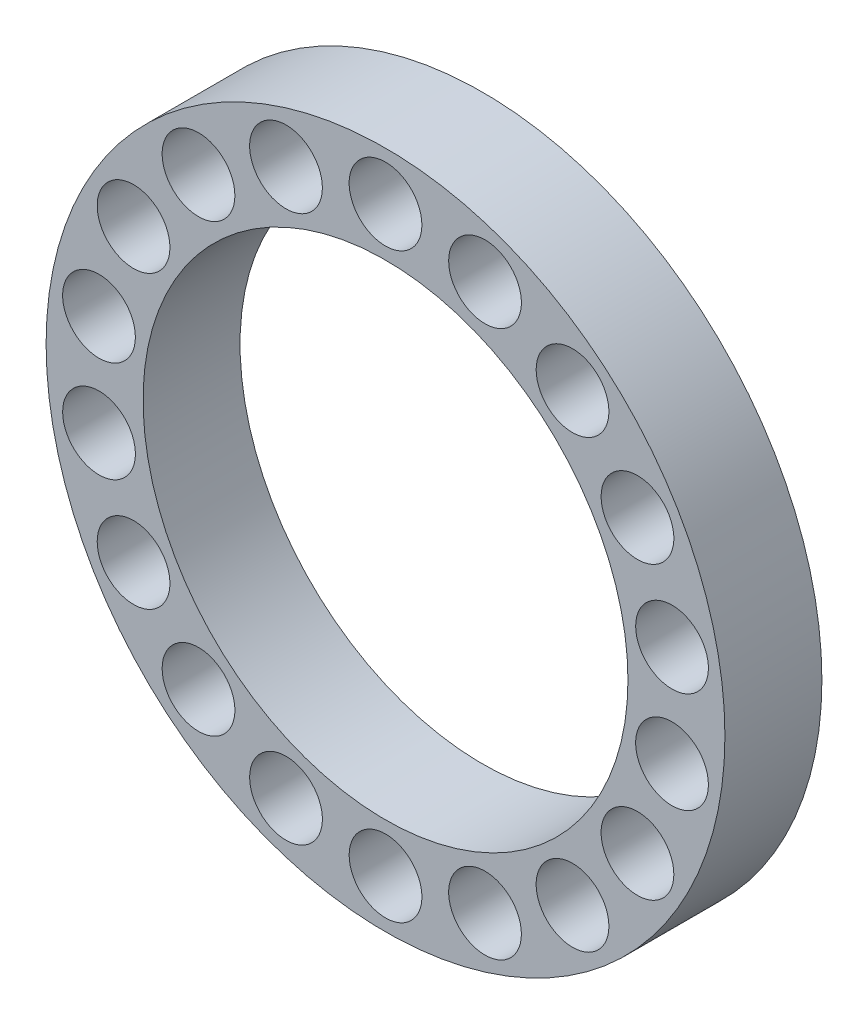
ISO-10303-21;
HEADER;
FILE_DESCRIPTION(('STEP AP214'),'2;1');
FILE_NAME('part.step','',(''),(''),'','','');
FILE_SCHEMA(('AUTOMOTIVE_DESIGN { 1 0 10303 214 1 1 1 1 }'));
ENDSEC;
DATA;
#1=APPLICATION_CONTEXT('core data for automotive mechanical design processes');
#2=APPLICATION_PROTOCOL_DEFINITION('international standard','automotive_design',2000,#1);
#3=PRODUCT_CONTEXT('',#1,'mechanical');
#4=PRODUCT('Part','Part','',(#3));
#5=PRODUCT_RELATED_PRODUCT_CATEGORY('part','',(#4));
#6=PRODUCT_DEFINITION_FORMATION('','',#4);
#7=PRODUCT_DEFINITION_CONTEXT('part definition',#1,'design');
#8=PRODUCT_DEFINITION('design','',#6,#7);
#9=PRODUCT_DEFINITION_SHAPE('','',#8);
#10=(LENGTH_UNIT() NAMED_UNIT(*) SI_UNIT(.MILLI.,.METRE.));
#11=(NAMED_UNIT(*) PLANE_ANGLE_UNIT() SI_UNIT($,.RADIAN.));
#12=(NAMED_UNIT(*) SI_UNIT($,.STERADIAN.) SOLID_ANGLE_UNIT());
#13=UNCERTAINTY_MEASURE_WITH_UNIT(LENGTH_MEASURE(1.E-05),#10,'distance_accuracy_value','');
#14=(GEOMETRIC_REPRESENTATION_CONTEXT(3) GLOBAL_UNCERTAINTY_ASSIGNED_CONTEXT((#13)) GLOBAL_UNIT_ASSIGNED_CONTEXT((#10,
#11,#12)) REPRESENTATION_CONTEXT('',''));
#15=CARTESIAN_POINT('',(0.,0.,0.));
#16=DIRECTION('',(0.,0.,1.));
#17=DIRECTION('',(1.,0.,0.));
#18=AXIS2_PLACEMENT_3D('',#15,#16,#17);
#19=CARTESIAN_POINT('',(0.,0.,2.54));
#20=DIRECTION('',(0.,0.,1.));
#21=DIRECTION('',(1.,0.,0.));
#22=AXIS2_PLACEMENT_3D('',#19,#20,#21);
#23=PLANE('',#22);
#24=CARTESIAN_POINT('',(6.59911357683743,3.80999999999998,2.54));
#25=DIRECTION('',(0.,0.,1.));
#26=DIRECTION('',(-1.,0.,0.));
#27=AXIS2_PLACEMENT_3D('',#24,#25,#26);
#28=CIRCLE('',#27,0.9525);
#29=CARTESIAN_POINT('',(5.64661357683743,3.80999999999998,2.54));
#30=VERTEX_POINT('',#29);
#31=EDGE_CURVE('E142',#30,#30,#28,.T.);
#32=ORIENTED_EDGE('',*,*,#31,.F.);
#33=EDGE_LOOP('',(#32));
#34=FACE_BOUND('',#33,.T.);
#35=CARTESIAN_POINT('',(2.6061934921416,7.16045777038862,2.54));
#36=DIRECTION('',(0.,0.,1.));
#37=DIRECTION('',(-1.,0.,0.));
#38=AXIS2_PLACEMENT_3D('',#35,#36,#37);
#39=CIRCLE('',#38,0.952500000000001);
#40=CARTESIAN_POINT('',(1.6536934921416,7.16045777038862,2.54));
#41=VERTEX_POINT('',#40);
#42=EDGE_CURVE('E130',#41,#41,#39,.T.);
#43=ORIENTED_EDGE('',*,*,#42,.F.);
#44=EDGE_LOOP('',(#43));
#45=FACE_BOUND('',#44,.T.);
#46=CARTESIAN_POINT('',(7.50423507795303,-1.32319911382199,2.54));
#47=DIRECTION('',(0.,0.,1.));
#48=DIRECTION('',(1.,0.,0.));
#49=AXIS2_PLACEMENT_3D('',#46,#47,#48);
#50=CIRCLE('',#49,0.952499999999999);
#51=CARTESIAN_POINT('',(8.45673507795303,-1.32319911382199,2.54));
#52=VERTEX_POINT('',#51);
#53=EDGE_CURVE('E118',#52,#52,#50,.T.);
#54=ORIENTED_EDGE('',*,*,#53,.F.);
#55=EDGE_LOOP('',(#54));
#56=FACE_BOUND('',#55,.T.);
#57=CARTESIAN_POINT('',(4.89804158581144,-5.83725865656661,2.54));
#58=DIRECTION('',(0.,0.,1.));
#59=DIRECTION('',(1.,0.,0.));
#60=AXIS2_PLACEMENT_3D('',#57,#58,#59);
#61=CIRCLE('',#60,0.952500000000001);
#62=CARTESIAN_POINT('',(5.85054158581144,-5.83725865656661,2.54));
#63=VERTEX_POINT('',#62);
#64=EDGE_CURVE('E106',#63,#63,#61,.T.);
#65=ORIENTED_EDGE('',*,*,#64,.F.);
#66=EDGE_LOOP('',(#65));
#67=FACE_BOUND('',#66,.T.);
#68=CARTESIAN_POINT('',(-6.59911357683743,-3.80999999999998,2.54));
#69=DIRECTION('',(0.,0.,1.));
#70=DIRECTION('',(-1.,0.,0.));
#71=AXIS2_PLACEMENT_3D('',#68,#69,#70);
#72=CIRCLE('',#71,0.9525);
#73=CARTESIAN_POINT('',(-7.55161357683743,-3.80999999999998,2.54));
#74=VERTEX_POINT('',#73);
#75=EDGE_CURVE('E94',#74,#74,#72,.T.);
#76=ORIENTED_EDGE('',*,*,#75,.F.);
#77=EDGE_LOOP('',(#76));
#78=FACE_BOUND('',#77,.T.);
#79=CARTESIAN_POINT('',(0.,-7.62,2.54));
#80=DIRECTION('',(0.,0.,1.));
#81=DIRECTION('',(-1.,0.,0.));
#82=AXIS2_PLACEMENT_3D('',#79,#80,#81);
#83=CIRCLE('',#82,0.9525);
#84=CARTESIAN_POINT('',(-0.9525,-7.62,2.54));
#85=VERTEX_POINT('',#84);
#86=EDGE_CURVE('E82',#85,#85,#83,.T.);
#87=ORIENTED_EDGE('',*,*,#86,.F.);
#88=EDGE_LOOP('',(#87));
#89=FACE_BOUND('',#88,.T.);
#90=CARTESIAN_POINT('',(-2.6061934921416,7.16045777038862,2.54));
#91=DIRECTION('',(0.,0.,1.));
#92=DIRECTION('',(1.,0.,0.));
#93=AXIS2_PLACEMENT_3D('',#90,#91,#92);
#94=CIRCLE('',#93,0.952500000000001);
#95=CARTESIAN_POINT('',(-1.6536934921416,7.16045777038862,2.54));
#96=VERTEX_POINT('',#95);
#97=EDGE_CURVE('E70',#96,#96,#94,.T.);
#98=ORIENTED_EDGE('',*,*,#97,.F.);
#99=EDGE_LOOP('',(#98));
#100=FACE_BOUND('',#99,.T.);
#101=CARTESIAN_POINT('',(-6.59911357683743,3.80999999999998,2.54));
#102=DIRECTION('',(0.,0.,1.));
#103=DIRECTION('',(1.,0.,0.));
#104=AXIS2_PLACEMENT_3D('',#101,#102,#103);
#105=CIRCLE('',#104,0.9525);
#106=CARTESIAN_POINT('',(-5.64661357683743,3.80999999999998,2.54));
#107=VERTEX_POINT('',#106);
#108=EDGE_CURVE('E58',#107,#107,#105,.T.);
#109=ORIENTED_EDGE('',*,*,#108,.F.);
#110=EDGE_LOOP('',(#109));
#111=FACE_BOUND('',#110,.T.);
#112=CARTESIAN_POINT('',(-4.89804158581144,5.83725865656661,2.54));
#113=DIRECTION('',(0.,0.,1.));
#114=DIRECTION('',(1.,0.,0.));
#115=AXIS2_PLACEMENT_3D('',#112,#113,#114);
#116=CIRCLE('',#115,0.952500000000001);
#117=CARTESIAN_POINT('',(-3.94554158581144,5.83725865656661,2.54));
#118=VERTEX_POINT('',#117);
#119=EDGE_CURVE('E46',#118,#118,#116,.T.);
#120=ORIENTED_EDGE('',*,*,#119,.F.);
#121=EDGE_LOOP('',(#120));
#122=FACE_BOUND('',#121,.T.);
#123=CARTESIAN_POINT('',(0.,0.,2.54));
#124=DIRECTION('',(0.,0.,1.));
#125=DIRECTION('',(1.,0.,0.));
#126=AXIS2_PLACEMENT_3D('',#123,#124,#125);
#127=CIRCLE('',#126,8.89);
#128=CARTESIAN_POINT('',(8.89,0.,2.54));
#129=VERTEX_POINT('',#128);
#130=EDGE_CURVE('E10',#129,#129,#127,.T.);
#131=ORIENTED_EDGE('',*,*,#130,.T.);
#132=EDGE_LOOP('',(#131));
#133=FACE_BOUND('',#132,.T.);
#134=CARTESIAN_POINT('',(0.,0.,2.54));
#135=DIRECTION('',(0.,0.,1.));
#136=DIRECTION('',(1.,0.,0.));
#137=AXIS2_PLACEMENT_3D('',#134,#135,#136);
#138=CIRCLE('',#137,6.35);
#139=CARTESIAN_POINT('',(6.35,0.,2.54));
#140=VERTEX_POINT('',#139);
#141=EDGE_CURVE('E41',#140,#140,#138,.T.);
#142=ORIENTED_EDGE('',*,*,#141,.F.);
#143=EDGE_LOOP('',(#142));
#144=FACE_BOUND('',#143,.T.);
#145=CARTESIAN_POINT('',(-7.50423507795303,1.32319911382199,2.54));
#146=DIRECTION('',(0.,0.,1.));
#147=DIRECTION('',(1.,0.,0.));
#148=AXIS2_PLACEMENT_3D('',#145,#146,#147);
#149=CIRCLE('',#148,0.952499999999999);
#150=CARTESIAN_POINT('',(-6.55173507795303,1.32319911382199,2.54));
#151=VERTEX_POINT('',#150);
#152=EDGE_CURVE('E52',#151,#151,#149,.T.);
#153=ORIENTED_EDGE('',*,*,#152,.F.);
#154=EDGE_LOOP('',(#153));
#155=FACE_BOUND('',#154,.T.);
#156=CARTESIAN_POINT('',(0.,7.62,2.54));
#157=DIRECTION('',(0.,0.,1.));
#158=DIRECTION('',(1.,0.,0.));
#159=AXIS2_PLACEMENT_3D('',#156,#157,#158);
#160=CIRCLE('',#159,0.9525);
#161=CARTESIAN_POINT('',(0.9525,7.62,2.54));
#162=VERTEX_POINT('',#161);
#163=EDGE_CURVE('E64',#162,#162,#160,.T.);
#164=ORIENTED_EDGE('',*,*,#163,.F.);
#165=EDGE_LOOP('',(#164));
#166=FACE_BOUND('',#165,.T.);
#167=CARTESIAN_POINT('',(-2.6061934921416,-7.16045777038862,2.54));
#168=DIRECTION('',(0.,0.,1.));
#169=DIRECTION('',(-1.,0.,0.));
#170=AXIS2_PLACEMENT_3D('',#167,#168,#169);
#171=CIRCLE('',#170,0.952500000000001);
#172=CARTESIAN_POINT('',(-3.5586934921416,-7.16045777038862,2.54));
#173=VERTEX_POINT('',#172);
#174=EDGE_CURVE('E76',#173,#173,#171,.T.);
#175=ORIENTED_EDGE('',*,*,#174,.F.);
#176=EDGE_LOOP('',(#175));
#177=FACE_BOUND('',#176,.T.);
#178=CARTESIAN_POINT('',(-7.50423507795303,-1.32319911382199,2.54));
#179=DIRECTION('',(0.,0.,1.));
#180=DIRECTION('',(-1.,0.,0.));
#181=AXIS2_PLACEMENT_3D('',#178,#179,#180);
#182=CIRCLE('',#181,0.952499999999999);
#183=CARTESIAN_POINT('',(-8.45673507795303,-1.32319911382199,2.54));
#184=VERTEX_POINT('',#183);
#185=EDGE_CURVE('E88',#184,#184,#182,.T.);
#186=ORIENTED_EDGE('',*,*,#185,.F.);
#187=EDGE_LOOP('',(#186));
#188=FACE_BOUND('',#187,.T.);
#189=CARTESIAN_POINT('',(-4.89804158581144,-5.83725865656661,2.54));
#190=DIRECTION('',(0.,0.,1.));
#191=DIRECTION('',(-1.,0.,0.));
#192=AXIS2_PLACEMENT_3D('',#189,#190,#191);
#193=CIRCLE('',#192,0.952500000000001);
#194=CARTESIAN_POINT('',(-5.85054158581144,-5.83725865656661,2.54));
#195=VERTEX_POINT('',#194);
#196=EDGE_CURVE('E100',#195,#195,#193,.T.);
#197=ORIENTED_EDGE('',*,*,#196,.F.);
#198=EDGE_LOOP('',(#197));
#199=FACE_BOUND('',#198,.T.);
#200=CARTESIAN_POINT('',(6.59911357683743,-3.80999999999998,2.54));
#201=DIRECTION('',(0.,0.,1.));
#202=DIRECTION('',(1.,0.,0.));
#203=AXIS2_PLACEMENT_3D('',#200,#201,#202);
#204=CIRCLE('',#203,0.9525);
#205=CARTESIAN_POINT('',(7.55161357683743,-3.80999999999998,2.54));
#206=VERTEX_POINT('',#205);
#207=EDGE_CURVE('E112',#206,#206,#204,.T.);
#208=ORIENTED_EDGE('',*,*,#207,.F.);
#209=EDGE_LOOP('',(#208));
#210=FACE_BOUND('',#209,.T.);
#211=CARTESIAN_POINT('',(2.6061934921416,-7.16045777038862,2.54));
#212=DIRECTION('',(0.,0.,1.));
#213=DIRECTION('',(1.,0.,0.));
#214=AXIS2_PLACEMENT_3D('',#211,#212,#213);
#215=CIRCLE('',#214,0.952500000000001);
#216=CARTESIAN_POINT('',(3.5586934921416,-7.16045777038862,2.54));
#217=VERTEX_POINT('',#216);
#218=EDGE_CURVE('E124',#217,#217,#215,.T.);
#219=ORIENTED_EDGE('',*,*,#218,.F.);
#220=EDGE_LOOP('',(#219));
#221=FACE_BOUND('',#220,.T.);
#222=CARTESIAN_POINT('',(7.50423507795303,1.32319911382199,2.54));
#223=DIRECTION('',(0.,0.,1.));
#224=DIRECTION('',(-1.,0.,0.));
#225=AXIS2_PLACEMENT_3D('',#222,#223,#224);
#226=CIRCLE('',#225,0.952499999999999);
#227=CARTESIAN_POINT('',(6.55173507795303,1.32319911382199,2.54));
#228=VERTEX_POINT('',#227);
#229=EDGE_CURVE('E136',#228,#228,#226,.T.);
#230=ORIENTED_EDGE('',*,*,#229,.F.);
#231=EDGE_LOOP('',(#230));
#232=FACE_BOUND('',#231,.T.);
#233=CARTESIAN_POINT('',(4.89804158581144,5.83725865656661,2.54));
#234=DIRECTION('',(0.,0.,1.));
#235=DIRECTION('',(-1.,0.,0.));
#236=AXIS2_PLACEMENT_3D('',#233,#234,#235);
#237=CIRCLE('',#236,0.952500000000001);
#238=CARTESIAN_POINT('',(3.94554158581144,5.83725865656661,2.54));
#239=VERTEX_POINT('',#238);
#240=EDGE_CURVE('E148',#239,#239,#237,.T.);
#241=ORIENTED_EDGE('',*,*,#240,.F.);
#242=EDGE_LOOP('',(#241));
#243=FACE_BOUND('',#242,.T.);
#244=ADVANCED_FACE('F30',(#34,#45,#56,#67,#78,#89,#100,#111,#122,#133,#144,#155,#166,#177,#188,
#199,#210,#221,#232,#243),#23,.T.);
#245=CARTESIAN_POINT('',(0.,0.,0.));
#246=DIRECTION('',(0.,0.,1.));
#247=DIRECTION('',(1.,0.,0.));
#248=AXIS2_PLACEMENT_3D('',#245,#246,#247);
#249=PLANE('',#248);
#250=CARTESIAN_POINT('',(6.59911357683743,3.80999999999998,0.));
#251=DIRECTION('',(0.,0.,1.));
#252=DIRECTION('',(-1.,0.,0.));
#253=AXIS2_PLACEMENT_3D('',#250,#251,#252);
#254=CIRCLE('',#253,0.9525);
#255=CARTESIAN_POINT('',(5.64661357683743,3.80999999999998,0.));
#256=VERTEX_POINT('',#255);
#257=EDGE_CURVE('E145',#256,#256,#254,.T.);
#258=ORIENTED_EDGE('',*,*,#257,.T.);
#259=EDGE_LOOP('',(#258));
#260=FACE_BOUND('',#259,.T.);
#261=CARTESIAN_POINT('',(2.6061934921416,7.16045777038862,0.));
#262=DIRECTION('',(0.,0.,1.));
#263=DIRECTION('',(-1.,0.,0.));
#264=AXIS2_PLACEMENT_3D('',#261,#262,#263);
#265=CIRCLE('',#264,0.952500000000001);
#266=CARTESIAN_POINT('',(1.6536934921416,7.16045777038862,0.));
#267=VERTEX_POINT('',#266);
#268=EDGE_CURVE('E133',#267,#267,#265,.T.);
#269=ORIENTED_EDGE('',*,*,#268,.T.);
#270=EDGE_LOOP('',(#269));
#271=FACE_BOUND('',#270,.T.);
#272=CARTESIAN_POINT('',(7.50423507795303,-1.32319911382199,0.));
#273=DIRECTION('',(0.,0.,1.));
#274=DIRECTION('',(1.,0.,0.));
#275=AXIS2_PLACEMENT_3D('',#272,#273,#274);
#276=CIRCLE('',#275,0.952499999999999);
#277=CARTESIAN_POINT('',(8.45673507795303,-1.32319911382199,0.));
#278=VERTEX_POINT('',#277);
#279=EDGE_CURVE('E121',#278,#278,#276,.T.);
#280=ORIENTED_EDGE('',*,*,#279,.T.);
#281=EDGE_LOOP('',(#280));
#282=FACE_BOUND('',#281,.T.);
#283=CARTESIAN_POINT('',(4.89804158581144,-5.83725865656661,0.));
#284=DIRECTION('',(0.,0.,1.));
#285=DIRECTION('',(1.,0.,0.));
#286=AXIS2_PLACEMENT_3D('',#283,#284,#285);
#287=CIRCLE('',#286,0.952500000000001);
#288=CARTESIAN_POINT('',(5.85054158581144,-5.83725865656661,0.));
#289=VERTEX_POINT('',#288);
#290=EDGE_CURVE('E109',#289,#289,#287,.T.);
#291=ORIENTED_EDGE('',*,*,#290,.T.);
#292=EDGE_LOOP('',(#291));
#293=FACE_BOUND('',#292,.T.);
#294=CARTESIAN_POINT('',(-6.59911357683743,-3.80999999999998,0.));
#295=DIRECTION('',(0.,0.,1.));
#296=DIRECTION('',(-1.,0.,0.));
#297=AXIS2_PLACEMENT_3D('',#294,#295,#296);
#298=CIRCLE('',#297,0.9525);
#299=CARTESIAN_POINT('',(-7.55161357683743,-3.80999999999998,0.));
#300=VERTEX_POINT('',#299);
#301=EDGE_CURVE('E97',#300,#300,#298,.T.);
#302=ORIENTED_EDGE('',*,*,#301,.T.);
#303=EDGE_LOOP('',(#302));
#304=FACE_BOUND('',#303,.T.);
#305=CARTESIAN_POINT('',(0.,-7.62,0.));
#306=DIRECTION('',(0.,0.,1.));
#307=DIRECTION('',(-1.,0.,0.));
#308=AXIS2_PLACEMENT_3D('',#305,#306,#307);
#309=CIRCLE('',#308,0.9525);
#310=CARTESIAN_POINT('',(-0.9525,-7.62,0.));
#311=VERTEX_POINT('',#310);
#312=EDGE_CURVE('E85',#311,#311,#309,.T.);
#313=ORIENTED_EDGE('',*,*,#312,.T.);
#314=EDGE_LOOP('',(#313));
#315=FACE_BOUND('',#314,.T.);
#316=CARTESIAN_POINT('',(-2.6061934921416,7.16045777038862,0.));
#317=DIRECTION('',(0.,0.,1.));
#318=DIRECTION('',(1.,0.,0.));
#319=AXIS2_PLACEMENT_3D('',#316,#317,#318);
#320=CIRCLE('',#319,0.952500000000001);
#321=CARTESIAN_POINT('',(-1.6536934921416,7.16045777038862,0.));
#322=VERTEX_POINT('',#321);
#323=EDGE_CURVE('E73',#322,#322,#320,.T.);
#324=ORIENTED_EDGE('',*,*,#323,.T.);
#325=EDGE_LOOP('',(#324));
#326=FACE_BOUND('',#325,.T.);
#327=CARTESIAN_POINT('',(-6.59911357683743,3.80999999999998,0.));
#328=DIRECTION('',(0.,0.,1.));
#329=DIRECTION('',(1.,0.,0.));
#330=AXIS2_PLACEMENT_3D('',#327,#328,#329);
#331=CIRCLE('',#330,0.9525);
#332=CARTESIAN_POINT('',(-5.64661357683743,3.80999999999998,0.));
#333=VERTEX_POINT('',#332);
#334=EDGE_CURVE('E61',#333,#333,#331,.T.);
#335=ORIENTED_EDGE('',*,*,#334,.T.);
#336=EDGE_LOOP('',(#335));
#337=FACE_BOUND('',#336,.T.);
#338=CARTESIAN_POINT('',(-4.89804158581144,5.83725865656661,0.));
#339=DIRECTION('',(0.,0.,1.));
#340=DIRECTION('',(1.,0.,0.));
#341=AXIS2_PLACEMENT_3D('',#338,#339,#340);
#342=CIRCLE('',#341,0.952500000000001);
#343=CARTESIAN_POINT('',(-3.94554158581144,5.83725865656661,0.));
#344=VERTEX_POINT('',#343);
#345=EDGE_CURVE('E49',#344,#344,#342,.T.);
#346=ORIENTED_EDGE('',*,*,#345,.T.);
#347=EDGE_LOOP('',(#346));
#348=FACE_BOUND('',#347,.T.);
#349=CARTESIAN_POINT('',(0.,0.,0.));
#350=DIRECTION('',(0.,0.,1.));
#351=DIRECTION('',(1.,0.,0.));
#352=AXIS2_PLACEMENT_3D('',#349,#350,#351);
#353=CIRCLE('',#352,8.89);
#354=CARTESIAN_POINT('',(8.89,0.,0.));
#355=VERTEX_POINT('',#354);
#356=EDGE_CURVE('E34',#355,#355,#353,.T.);
#357=ORIENTED_EDGE('',*,*,#356,.F.);
#358=EDGE_LOOP('',(#357));
#359=FACE_BOUND('',#358,.T.);
#360=CARTESIAN_POINT('',(0.,0.,0.));
#361=DIRECTION('',(0.,0.,1.));
#362=DIRECTION('',(1.,0.,0.));
#363=AXIS2_PLACEMENT_3D('',#360,#361,#362);
#364=CIRCLE('',#363,6.35);
#365=CARTESIAN_POINT('',(6.35,0.,0.));
#366=VERTEX_POINT('',#365);
#367=EDGE_CURVE('E43',#366,#366,#364,.T.);
#368=ORIENTED_EDGE('',*,*,#367,.T.);
#369=EDGE_LOOP('',(#368));
#370=FACE_BOUND('',#369,.T.);
#371=CARTESIAN_POINT('',(-7.50423507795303,1.32319911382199,0.));
#372=DIRECTION('',(0.,0.,1.));
#373=DIRECTION('',(1.,0.,0.));
#374=AXIS2_PLACEMENT_3D('',#371,#372,#373);
#375=CIRCLE('',#374,0.952499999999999);
#376=CARTESIAN_POINT('',(-6.55173507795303,1.32319911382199,0.));
#377=VERTEX_POINT('',#376);
#378=EDGE_CURVE('E55',#377,#377,#375,.T.);
#379=ORIENTED_EDGE('',*,*,#378,.T.);
#380=EDGE_LOOP('',(#379));
#381=FACE_BOUND('',#380,.T.);
#382=CARTESIAN_POINT('',(0.,7.62,0.));
#383=DIRECTION('',(0.,0.,1.));
#384=DIRECTION('',(1.,0.,0.));
#385=AXIS2_PLACEMENT_3D('',#382,#383,#384);
#386=CIRCLE('',#385,0.9525);
#387=CARTESIAN_POINT('',(0.9525,7.62,0.));
#388=VERTEX_POINT('',#387);
#389=EDGE_CURVE('E67',#388,#388,#386,.T.);
#390=ORIENTED_EDGE('',*,*,#389,.T.);
#391=EDGE_LOOP('',(#390));
#392=FACE_BOUND('',#391,.T.);
#393=CARTESIAN_POINT('',(-2.6061934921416,-7.16045777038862,0.));
#394=DIRECTION('',(0.,0.,1.));
#395=DIRECTION('',(-1.,0.,0.));
#396=AXIS2_PLACEMENT_3D('',#393,#394,#395);
#397=CIRCLE('',#396,0.952500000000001);
#398=CARTESIAN_POINT('',(-3.5586934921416,-7.16045777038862,0.));
#399=VERTEX_POINT('',#398);
#400=EDGE_CURVE('E79',#399,#399,#397,.T.);
#401=ORIENTED_EDGE('',*,*,#400,.T.);
#402=EDGE_LOOP('',(#401));
#403=FACE_BOUND('',#402,.T.);
#404=CARTESIAN_POINT('',(-7.50423507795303,-1.32319911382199,0.));
#405=DIRECTION('',(0.,0.,1.));
#406=DIRECTION('',(-1.,0.,0.));
#407=AXIS2_PLACEMENT_3D('',#404,#405,#406);
#408=CIRCLE('',#407,0.952499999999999);
#409=CARTESIAN_POINT('',(-8.45673507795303,-1.32319911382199,0.));
#410=VERTEX_POINT('',#409);
#411=EDGE_CURVE('E91',#410,#410,#408,.T.);
#412=ORIENTED_EDGE('',*,*,#411,.T.);
#413=EDGE_LOOP('',(#412));
#414=FACE_BOUND('',#413,.T.);
#415=CARTESIAN_POINT('',(-4.89804158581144,-5.83725865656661,0.));
#416=DIRECTION('',(0.,0.,1.));
#417=DIRECTION('',(-1.,0.,0.));
#418=AXIS2_PLACEMENT_3D('',#415,#416,#417);
#419=CIRCLE('',#418,0.952500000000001);
#420=CARTESIAN_POINT('',(-5.85054158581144,-5.83725865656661,0.));
#421=VERTEX_POINT('',#420);
#422=EDGE_CURVE('E103',#421,#421,#419,.T.);
#423=ORIENTED_EDGE('',*,*,#422,.T.);
#424=EDGE_LOOP('',(#423));
#425=FACE_BOUND('',#424,.T.);
#426=CARTESIAN_POINT('',(6.59911357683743,-3.80999999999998,0.));
#427=DIRECTION('',(0.,0.,1.));
#428=DIRECTION('',(1.,0.,0.));
#429=AXIS2_PLACEMENT_3D('',#426,#427,#428);
#430=CIRCLE('',#429,0.9525);
#431=CARTESIAN_POINT('',(7.55161357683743,-3.80999999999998,0.));
#432=VERTEX_POINT('',#431);
#433=EDGE_CURVE('E115',#432,#432,#430,.T.);
#434=ORIENTED_EDGE('',*,*,#433,.T.);
#435=EDGE_LOOP('',(#434));
#436=FACE_BOUND('',#435,.T.);
#437=CARTESIAN_POINT('',(2.6061934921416,-7.16045777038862,0.));
#438=DIRECTION('',(0.,0.,1.));
#439=DIRECTION('',(1.,0.,0.));
#440=AXIS2_PLACEMENT_3D('',#437,#438,#439);
#441=CIRCLE('',#440,0.952500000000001);
#442=CARTESIAN_POINT('',(3.5586934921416,-7.16045777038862,0.));
#443=VERTEX_POINT('',#442);
#444=EDGE_CURVE('E127',#443,#443,#441,.T.);
#445=ORIENTED_EDGE('',*,*,#444,.T.);
#446=EDGE_LOOP('',(#445));
#447=FACE_BOUND('',#446,.T.);
#448=CARTESIAN_POINT('',(7.50423507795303,1.32319911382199,0.));
#449=DIRECTION('',(0.,0.,1.));
#450=DIRECTION('',(-1.,0.,0.));
#451=AXIS2_PLACEMENT_3D('',#448,#449,#450);
#452=CIRCLE('',#451,0.952499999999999);
#453=CARTESIAN_POINT('',(6.55173507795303,1.32319911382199,0.));
#454=VERTEX_POINT('',#453);
#455=EDGE_CURVE('E139',#454,#454,#452,.T.);
#456=ORIENTED_EDGE('',*,*,#455,.T.);
#457=EDGE_LOOP('',(#456));
#458=FACE_BOUND('',#457,.T.);
#459=CARTESIAN_POINT('',(4.89804158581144,5.83725865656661,0.));
#460=DIRECTION('',(0.,0.,1.));
#461=DIRECTION('',(-1.,0.,0.));
#462=AXIS2_PLACEMENT_3D('',#459,#460,#461);
#463=CIRCLE('',#462,0.952500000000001);
#464=CARTESIAN_POINT('',(3.94554158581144,5.83725865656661,0.));
#465=VERTEX_POINT('',#464);
#466=EDGE_CURVE('E151',#465,#465,#463,.T.);
#467=ORIENTED_EDGE('',*,*,#466,.T.);
#468=EDGE_LOOP('',(#467));
#469=FACE_BOUND('',#468,.T.);
#470=ADVANCED_FACE('F161',(#260,#271,#282,#293,#304,#315,#326,#337,#348,#359,#370,#381,#392,
#403,#414,#425,#436,#447,#458,#469),#249,.F.);
#471=CARTESIAN_POINT('',(0.,0.,2.54));
#472=DIRECTION('',(0.,0.,-1.));
#473=DIRECTION('',(-1.,0.,0.));
#474=AXIS2_PLACEMENT_3D('',#471,#472,#473);
#475=CYLINDRICAL_SURFACE('',#474,8.89);
#476=ORIENTED_EDGE('',*,*,#130,.F.);
#477=EDGE_LOOP('',(#476));
#478=FACE_BOUND('',#477,.T.);
#479=ORIENTED_EDGE('',*,*,#356,.T.);
#480=EDGE_LOOP('',(#479));
#481=FACE_BOUND('',#480,.T.);
#482=ADVANCED_FACE('F32',(#478,#481),#475,.T.);
#483=CARTESIAN_POINT('',(0.,0.,2.54));
#484=DIRECTION('',(0.,0.,-1.));
#485=DIRECTION('',(-1.,0.,0.));
#486=AXIS2_PLACEMENT_3D('',#483,#484,#485);
#487=CYLINDRICAL_SURFACE('',#486,6.35);
#488=ORIENTED_EDGE('',*,*,#141,.T.);
#489=EDGE_LOOP('',(#488));
#490=FACE_BOUND('',#489,.T.);
#491=ORIENTED_EDGE('',*,*,#367,.F.);
#492=EDGE_LOOP('',(#491));
#493=FACE_BOUND('',#492,.T.);
#494=ADVANCED_FACE('F171',(#490,#493),#487,.F.);
#495=CARTESIAN_POINT('',(-4.89804158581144,5.83725865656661,2.54));
#496=DIRECTION('',(0.,0.,-1.));
#497=DIRECTION('',(-1.,0.,0.));
#498=AXIS2_PLACEMENT_3D('',#495,#496,#497);
#499=CYLINDRICAL_SURFACE('',#498,0.952500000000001);
#500=ORIENTED_EDGE('',*,*,#119,.T.);
#501=EDGE_LOOP('',(#500));
#502=FACE_BOUND('',#501,.T.);
#503=ORIENTED_EDGE('',*,*,#345,.F.);
#504=EDGE_LOOP('',(#503));
#505=FACE_BOUND('',#504,.T.);
#506=ADVANCED_FACE('F174',(#502,#505),#499,.F.);
#507=CARTESIAN_POINT('',(-7.50423507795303,1.32319911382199,2.54));
#508=DIRECTION('',(0.,0.,-1.));
#509=DIRECTION('',(-1.,0.,0.));
#510=AXIS2_PLACEMENT_3D('',#507,#508,#509);
#511=CYLINDRICAL_SURFACE('',#510,0.952499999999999);
#512=ORIENTED_EDGE('',*,*,#152,.T.);
#513=EDGE_LOOP('',(#512));
#514=FACE_BOUND('',#513,.T.);
#515=ORIENTED_EDGE('',*,*,#378,.F.);
#516=EDGE_LOOP('',(#515));
#517=FACE_BOUND('',#516,.T.);
#518=ADVANCED_FACE('F178',(#514,#517),#511,.F.);
#519=CARTESIAN_POINT('',(-6.59911357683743,3.80999999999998,2.54));
#520=DIRECTION('',(0.,0.,-1.));
#521=DIRECTION('',(-1.,0.,0.));
#522=AXIS2_PLACEMENT_3D('',#519,#520,#521);
#523=CYLINDRICAL_SURFACE('',#522,0.9525);
#524=ORIENTED_EDGE('',*,*,#108,.T.);
#525=EDGE_LOOP('',(#524));
#526=FACE_BOUND('',#525,.T.);
#527=ORIENTED_EDGE('',*,*,#334,.F.);
#528=EDGE_LOOP('',(#527));
#529=FACE_BOUND('',#528,.T.);
#530=ADVANCED_FACE('F182',(#526,#529),#523,.F.);
#531=CARTESIAN_POINT('',(0.,7.62,2.54));
#532=DIRECTION('',(0.,0.,-1.));
#533=DIRECTION('',(-1.,0.,0.));
#534=AXIS2_PLACEMENT_3D('',#531,#532,#533);
#535=CYLINDRICAL_SURFACE('',#534,0.9525);
#536=ORIENTED_EDGE('',*,*,#163,.T.);
#537=EDGE_LOOP('',(#536));
#538=FACE_BOUND('',#537,.T.);
#539=ORIENTED_EDGE('',*,*,#389,.F.);
#540=EDGE_LOOP('',(#539));
#541=FACE_BOUND('',#540,.T.);
#542=ADVANCED_FACE('F186',(#538,#541),#535,.F.);
#543=CARTESIAN_POINT('',(-2.6061934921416,7.16045777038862,2.54));
#544=DIRECTION('',(0.,0.,-1.));
#545=DIRECTION('',(-1.,0.,0.));
#546=AXIS2_PLACEMENT_3D('',#543,#544,#545);
#547=CYLINDRICAL_SURFACE('',#546,0.952500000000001);
#548=ORIENTED_EDGE('',*,*,#97,.T.);
#549=EDGE_LOOP('',(#548));
#550=FACE_BOUND('',#549,.T.);
#551=ORIENTED_EDGE('',*,*,#323,.F.);
#552=EDGE_LOOP('',(#551));
#553=FACE_BOUND('',#552,.T.);
#554=ADVANCED_FACE('F190',(#550,#553),#547,.F.);
#555=CARTESIAN_POINT('',(-2.6061934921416,-7.16045777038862,2.54));
#556=DIRECTION('',(0.,0.,-1.));
#557=DIRECTION('',(-1.,0.,0.));
#558=AXIS2_PLACEMENT_3D('',#555,#556,#557);
#559=CYLINDRICAL_SURFACE('',#558,0.952500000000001);
#560=ORIENTED_EDGE('',*,*,#174,.T.);
#561=EDGE_LOOP('',(#560));
#562=FACE_BOUND('',#561,.T.);
#563=ORIENTED_EDGE('',*,*,#400,.F.);
#564=EDGE_LOOP('',(#563));
#565=FACE_BOUND('',#564,.T.);
#566=ADVANCED_FACE('F194',(#562,#565),#559,.F.);
#567=CARTESIAN_POINT('',(0.,-7.62,2.54));
#568=DIRECTION('',(0.,0.,-1.));
#569=DIRECTION('',(-1.,0.,0.));
#570=AXIS2_PLACEMENT_3D('',#567,#568,#569);
#571=CYLINDRICAL_SURFACE('',#570,0.9525);
#572=ORIENTED_EDGE('',*,*,#86,.T.);
#573=EDGE_LOOP('',(#572));
#574=FACE_BOUND('',#573,.T.);
#575=ORIENTED_EDGE('',*,*,#312,.F.);
#576=EDGE_LOOP('',(#575));
#577=FACE_BOUND('',#576,.T.);
#578=ADVANCED_FACE('F198',(#574,#577),#571,.F.);
#579=CARTESIAN_POINT('',(-7.50423507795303,-1.32319911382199,2.54));
#580=DIRECTION('',(0.,0.,-1.));
#581=DIRECTION('',(-1.,0.,0.));
#582=AXIS2_PLACEMENT_3D('',#579,#580,#581);
#583=CYLINDRICAL_SURFACE('',#582,0.952499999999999);
#584=ORIENTED_EDGE('',*,*,#185,.T.);
#585=EDGE_LOOP('',(#584));
#586=FACE_BOUND('',#585,.T.);
#587=ORIENTED_EDGE('',*,*,#411,.F.);
#588=EDGE_LOOP('',(#587));
#589=FACE_BOUND('',#588,.T.);
#590=ADVANCED_FACE('F202',(#586,#589),#583,.F.);
#591=CARTESIAN_POINT('',(-6.59911357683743,-3.80999999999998,2.54));
#592=DIRECTION('',(0.,0.,-1.));
#593=DIRECTION('',(-1.,0.,0.));
#594=AXIS2_PLACEMENT_3D('',#591,#592,#593);
#595=CYLINDRICAL_SURFACE('',#594,0.9525);
#596=ORIENTED_EDGE('',*,*,#75,.T.);
#597=EDGE_LOOP('',(#596));
#598=FACE_BOUND('',#597,.T.);
#599=ORIENTED_EDGE('',*,*,#301,.F.);
#600=EDGE_LOOP('',(#599));
#601=FACE_BOUND('',#600,.T.);
#602=ADVANCED_FACE('F206',(#598,#601),#595,.F.);
#603=CARTESIAN_POINT('',(-4.89804158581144,-5.83725865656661,2.54));
#604=DIRECTION('',(0.,0.,-1.));
#605=DIRECTION('',(-1.,0.,0.));
#606=AXIS2_PLACEMENT_3D('',#603,#604,#605);
#607=CYLINDRICAL_SURFACE('',#606,0.952500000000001);
#608=ORIENTED_EDGE('',*,*,#196,.T.);
#609=EDGE_LOOP('',(#608));
#610=FACE_BOUND('',#609,.T.);
#611=ORIENTED_EDGE('',*,*,#422,.F.);
#612=EDGE_LOOP('',(#611));
#613=FACE_BOUND('',#612,.T.);
#614=ADVANCED_FACE('F210',(#610,#613),#607,.F.);
#615=CARTESIAN_POINT('',(4.89804158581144,-5.83725865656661,2.54));
#616=DIRECTION('',(0.,0.,-1.));
#617=DIRECTION('',(-1.,0.,0.));
#618=AXIS2_PLACEMENT_3D('',#615,#616,#617);
#619=CYLINDRICAL_SURFACE('',#618,0.952500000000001);
#620=ORIENTED_EDGE('',*,*,#64,.T.);
#621=EDGE_LOOP('',(#620));
#622=FACE_BOUND('',#621,.T.);
#623=ORIENTED_EDGE('',*,*,#290,.F.);
#624=EDGE_LOOP('',(#623));
#625=FACE_BOUND('',#624,.T.);
#626=ADVANCED_FACE('F214',(#622,#625),#619,.F.);
#627=CARTESIAN_POINT('',(6.59911357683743,-3.80999999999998,2.54));
#628=DIRECTION('',(0.,0.,-1.));
#629=DIRECTION('',(-1.,0.,0.));
#630=AXIS2_PLACEMENT_3D('',#627,#628,#629);
#631=CYLINDRICAL_SURFACE('',#630,0.9525);
#632=ORIENTED_EDGE('',*,*,#207,.T.);
#633=EDGE_LOOP('',(#632));
#634=FACE_BOUND('',#633,.T.);
#635=ORIENTED_EDGE('',*,*,#433,.F.);
#636=EDGE_LOOP('',(#635));
#637=FACE_BOUND('',#636,.T.);
#638=ADVANCED_FACE('F218',(#634,#637),#631,.F.);
#639=CARTESIAN_POINT('',(7.50423507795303,-1.32319911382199,2.54));
#640=DIRECTION('',(0.,0.,-1.));
#641=DIRECTION('',(-1.,0.,0.));
#642=AXIS2_PLACEMENT_3D('',#639,#640,#641);
#643=CYLINDRICAL_SURFACE('',#642,0.952499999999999);
#644=ORIENTED_EDGE('',*,*,#53,.T.);
#645=EDGE_LOOP('',(#644));
#646=FACE_BOUND('',#645,.T.);
#647=ORIENTED_EDGE('',*,*,#279,.F.);
#648=EDGE_LOOP('',(#647));
#649=FACE_BOUND('',#648,.T.);
#650=ADVANCED_FACE('F222',(#646,#649),#643,.F.);
#651=CARTESIAN_POINT('',(2.6061934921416,-7.16045777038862,2.54));
#652=DIRECTION('',(0.,0.,-1.));
#653=DIRECTION('',(-1.,0.,0.));
#654=AXIS2_PLACEMENT_3D('',#651,#652,#653);
#655=CYLINDRICAL_SURFACE('',#654,0.952500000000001);
#656=ORIENTED_EDGE('',*,*,#218,.T.);
#657=EDGE_LOOP('',(#656));
#658=FACE_BOUND('',#657,.T.);
#659=ORIENTED_EDGE('',*,*,#444,.F.);
#660=EDGE_LOOP('',(#659));
#661=FACE_BOUND('',#660,.T.);
#662=ADVANCED_FACE('F226',(#658,#661),#655,.F.);
#663=CARTESIAN_POINT('',(2.6061934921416,7.16045777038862,2.54));
#664=DIRECTION('',(0.,0.,-1.));
#665=DIRECTION('',(-1.,0.,0.));
#666=AXIS2_PLACEMENT_3D('',#663,#664,#665);
#667=CYLINDRICAL_SURFACE('',#666,0.952500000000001);
#668=ORIENTED_EDGE('',*,*,#42,.T.);
#669=EDGE_LOOP('',(#668));
#670=FACE_BOUND('',#669,.T.);
#671=ORIENTED_EDGE('',*,*,#268,.F.);
#672=EDGE_LOOP('',(#671));
#673=FACE_BOUND('',#672,.T.);
#674=ADVANCED_FACE('F230',(#670,#673),#667,.F.);
#675=CARTESIAN_POINT('',(7.50423507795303,1.32319911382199,2.54));
#676=DIRECTION('',(0.,0.,-1.));
#677=DIRECTION('',(-1.,0.,0.));
#678=AXIS2_PLACEMENT_3D('',#675,#676,#677);
#679=CYLINDRICAL_SURFACE('',#678,0.952499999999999);
#680=ORIENTED_EDGE('',*,*,#229,.T.);
#681=EDGE_LOOP('',(#680));
#682=FACE_BOUND('',#681,.T.);
#683=ORIENTED_EDGE('',*,*,#455,.F.);
#684=EDGE_LOOP('',(#683));
#685=FACE_BOUND('',#684,.T.);
#686=ADVANCED_FACE('F234',(#682,#685),#679,.F.);
#687=CARTESIAN_POINT('',(6.59911357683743,3.80999999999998,2.54));
#688=DIRECTION('',(0.,0.,-1.));
#689=DIRECTION('',(-1.,0.,0.));
#690=AXIS2_PLACEMENT_3D('',#687,#688,#689);
#691=CYLINDRICAL_SURFACE('',#690,0.9525);
#692=ORIENTED_EDGE('',*,*,#31,.T.);
#693=EDGE_LOOP('',(#692));
#694=FACE_BOUND('',#693,.T.);
#695=ORIENTED_EDGE('',*,*,#257,.F.);
#696=EDGE_LOOP('',(#695));
#697=FACE_BOUND('',#696,.T.);
#698=ADVANCED_FACE('F238',(#694,#697),#691,.F.);
#699=CARTESIAN_POINT('',(4.89804158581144,5.83725865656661,2.54));
#700=DIRECTION('',(0.,0.,-1.));
#701=DIRECTION('',(-1.,0.,0.));
#702=AXIS2_PLACEMENT_3D('',#699,#700,#701);
#703=CYLINDRICAL_SURFACE('',#702,0.952500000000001);
#704=ORIENTED_EDGE('',*,*,#240,.T.);
#705=EDGE_LOOP('',(#704));
#706=FACE_BOUND('',#705,.T.);
#707=ORIENTED_EDGE('',*,*,#466,.F.);
#708=EDGE_LOOP('',(#707));
#709=FACE_BOUND('',#708,.T.);
#710=ADVANCED_FACE('F157',(#706,#709),#703,.F.);
#711=CLOSED_SHELL('',(#244,#470,#482,#494,#506,#518,#530,#542,#554,#566,#578,#590,#602,#614,
#626,#638,#650,#662,#674,#686,#698,#710));
#712=MANIFOLD_SOLID_BREP('B2',#711);
#713=ADVANCED_BREP_SHAPE_REPRESENTATION('',(#18,#712),#14);
#714=SHAPE_DEFINITION_REPRESENTATION(#9,#713);
ENDSEC;
END-ISO-10303-21;
